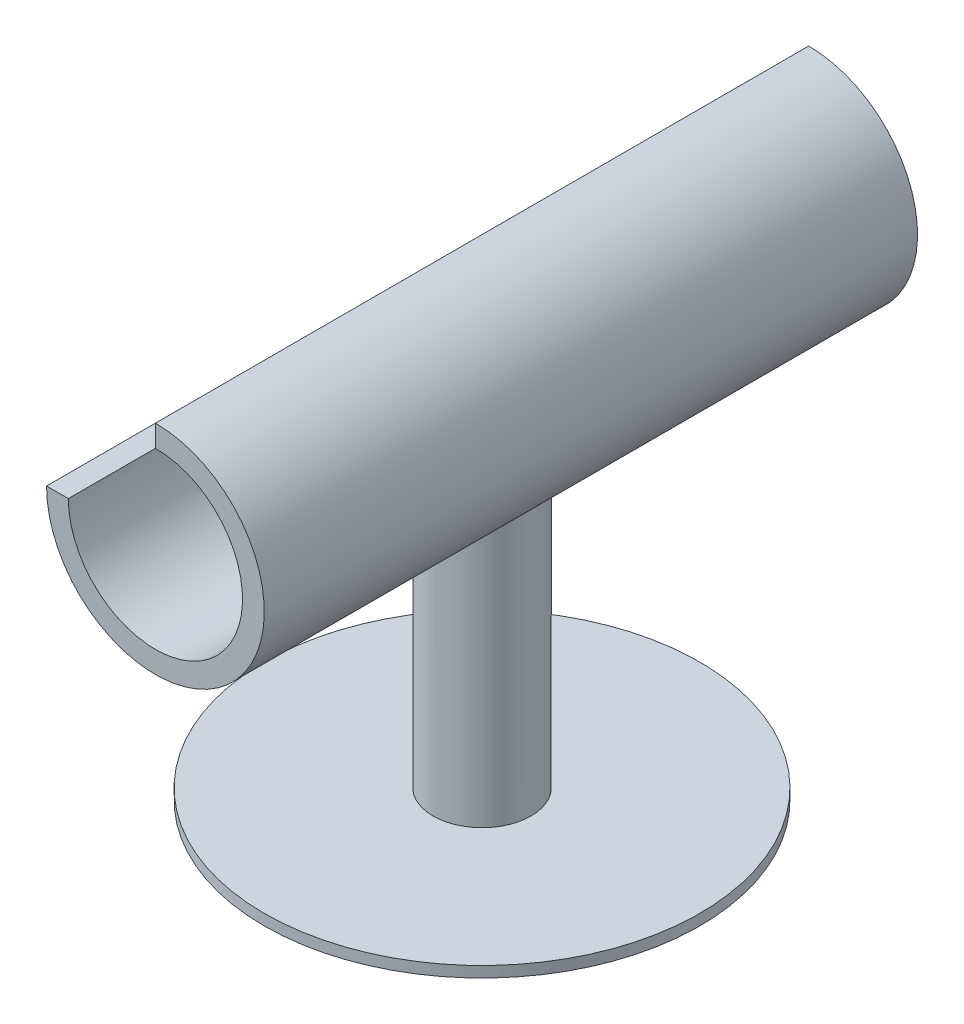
ISO-10303-21;
HEADER;
FILE_DESCRIPTION(('STEP AP214'),'2;1');
FILE_NAME('part.step','',(''),(''),'','','');
FILE_SCHEMA(('AUTOMOTIVE_DESIGN { 1 0 10303 214 1 1 1 1 }'));
ENDSEC;
DATA;
#1=APPLICATION_CONTEXT('core data for automotive mechanical design processes');
#2=APPLICATION_PROTOCOL_DEFINITION('international standard','automotive_design',2000,#1);
#3=PRODUCT_CONTEXT('',#1,'mechanical');
#4=PRODUCT('Part','Part','',(#3));
#5=PRODUCT_RELATED_PRODUCT_CATEGORY('part','',(#4));
#6=PRODUCT_DEFINITION_FORMATION('','',#4);
#7=PRODUCT_DEFINITION_CONTEXT('part definition',#1,'design');
#8=PRODUCT_DEFINITION('design','',#6,#7);
#9=PRODUCT_DEFINITION_SHAPE('','',#8);
#10=(LENGTH_UNIT() NAMED_UNIT(*) SI_UNIT(.MILLI.,.METRE.));
#11=(NAMED_UNIT(*) PLANE_ANGLE_UNIT() SI_UNIT($,.RADIAN.));
#12=(NAMED_UNIT(*) SI_UNIT($,.STERADIAN.) SOLID_ANGLE_UNIT());
#13=UNCERTAINTY_MEASURE_WITH_UNIT(LENGTH_MEASURE(1.E-05),#10,'distance_accuracy_value','');
#14=(GEOMETRIC_REPRESENTATION_CONTEXT(3) GLOBAL_UNCERTAINTY_ASSIGNED_CONTEXT((#13)) GLOBAL_UNIT_ASSIGNED_CONTEXT((#10,
#11,#12)) REPRESENTATION_CONTEXT('',''));
#15=CARTESIAN_POINT('',(0.,0.,0.));
#16=DIRECTION('',(0.,0.,1.));
#17=DIRECTION('',(1.,0.,0.));
#18=AXIS2_PLACEMENT_3D('',#15,#16,#17);
#19=CARTESIAN_POINT('',(0.,0.,120.));
#20=DIRECTION('',(0.,0.,-1.));
#21=DIRECTION('',(-1.,0.,0.));
#22=AXIS2_PLACEMENT_3D('',#19,#20,#21);
#23=CYLINDRICAL_SURFACE('',#22,20.);
#24=CARTESIAN_POINT('',(0.,0.,0.));
#25=DIRECTION('',(0.,0.,1.));
#26=DIRECTION('',(1.,0.,0.));
#27=AXIS2_PLACEMENT_3D('',#24,#25,#26);
#28=CIRCLE('',#27,20.);
#29=CARTESIAN_POINT('',(-20.,0.,0.));
#30=VERTEX_POINT('',#29);
#31=CARTESIAN_POINT('',(0.,20.,0.));
#32=VERTEX_POINT('',#31);
#33=EDGE_CURVE('E87',#30,#32,#28,.T.);
#34=ORIENTED_EDGE('',*,*,#33,.T.);
#35=DIRECTION('',(0.,0.,-1.));
#36=VECTOR('',#35,1.);
#37=CARTESIAN_POINT('',(0.,20.,120.));
#38=LINE('',#37,#36);
#39=CARTESIAN_POINT('',(0.,20.,120.));
#40=VERTEX_POINT('',#39);
#41=EDGE_CURVE('E129',#32,#40,#38,.F.);
#42=ORIENTED_EDGE('',*,*,#41,.T.);
#43=CARTESIAN_POINT('',(0.,0.,120.));
#44=DIRECTION('',(0.,0.,1.));
#45=DIRECTION('',(1.,0.,0.));
#46=AXIS2_PLACEMENT_3D('',#43,#44,#45);
#47=CIRCLE('',#46,20.);
#48=CARTESIAN_POINT('',(-20.,0.,120.));
#49=VERTEX_POINT('',#48);
#50=EDGE_CURVE('E84',#49,#40,#47,.T.);
#51=ORIENTED_EDGE('',*,*,#50,.F.);
#52=DIRECTION('',(0.,0.,-1.));
#53=VECTOR('',#52,1.);
#54=CARTESIAN_POINT('',(-20.,0.,120.));
#55=LINE('',#54,#53);
#56=EDGE_CURVE('E130',#49,#30,#55,.T.);
#57=ORIENTED_EDGE('',*,*,#56,.T.);
#58=EDGE_LOOP('',(#34,#42,#51,#57));
#59=FACE_BOUND('',#58,.T.);
#60=CARTESIAN_POINT('',(0.,-20.,51.));
#61=CARTESIAN_POINT('',(0.239429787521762,-19.9999985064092,51.0000017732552));
#62=CARTESIAN_POINT('',(0.478916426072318,-19.9956892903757,51.0095667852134));
#63=CARTESIAN_POINT('',(0.956162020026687,-19.9785592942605,51.0477313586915));
#64=CARTESIAN_POINT('',(1.19391993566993,-19.965733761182,51.0763415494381));
#65=CARTESIAN_POINT('',(1.66631126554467,-19.9318736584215,51.15235918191));
#66=CARTESIAN_POINT('',(1.90093746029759,-19.9108226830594,51.1998041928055));
#67=CARTESIAN_POINT('',(2.36491141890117,-19.8610585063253,51.3129852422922));
#68=CARTESIAN_POINT('',(2.5942588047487,-19.8323447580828,51.37872258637));
#69=CARTESIAN_POINT('',(3.04529734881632,-19.7681022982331,51.5275532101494));
#70=CARTESIAN_POINT('',(3.26701374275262,-19.7325992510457,51.6105812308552));
#71=CARTESIAN_POINT('',(3.70234023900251,-19.6555728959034,51.7933919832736));
#72=CARTESIAN_POINT('',(3.91595009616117,-19.6140494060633,51.8931752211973));
#73=CARTESIAN_POINT('',(4.33377259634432,-19.5259822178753,52.1086350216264));
#74=CARTESIAN_POINT('',(4.53798969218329,-19.4794409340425,52.2243039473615));
#75=CARTESIAN_POINT('',(4.93616834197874,-19.3823697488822,52.4707841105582));
#76=CARTESIAN_POINT('',(5.13012612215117,-19.3318383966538,52.6016008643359));
#77=CARTESIAN_POINT('',(5.51651224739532,-19.2252516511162,52.8846388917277));
#78=CARTESIAN_POINT('',(5.70834540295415,-19.1690457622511,53.0376162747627));
#79=CARTESIAN_POINT('',(6.07860491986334,-19.0548708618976,53.3584209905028));
#80=CARTESIAN_POINT('',(6.25703067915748,-18.9969017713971,53.5262489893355));
#81=CARTESIAN_POINT('',(6.59969716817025,-18.880592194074,53.8759516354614));
#82=CARTESIAN_POINT('',(6.76392725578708,-18.8222514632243,54.0578366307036));
#83=CARTESIAN_POINT('',(7.07712505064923,-18.7067409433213,54.4345454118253));
#84=CARTESIAN_POINT('',(7.2260976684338,-18.6495707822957,54.6293650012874));
#85=CARTESIAN_POINT('',(7.516447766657,-18.5345311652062,55.0431197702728));
#86=CARTESIAN_POINT('',(7.65683040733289,-18.4768262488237,55.2628006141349));
#87=CARTESIAN_POINT('',(7.9184082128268,-18.3662455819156,55.7143427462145));
#88=CARTESIAN_POINT('',(8.03961140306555,-18.3133678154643,55.9461988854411));
#89=CARTESIAN_POINT('',(8.26179801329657,-18.2142115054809,56.4207118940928));
#90=CARTESIAN_POINT('',(8.36278610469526,-18.1679314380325,56.6633662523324));
#91=CARTESIAN_POINT('',(8.54350708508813,-18.0836512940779,57.1578595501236));
#92=CARTESIAN_POINT('',(8.62324185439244,-18.0456504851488,57.4096976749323));
#93=CARTESIAN_POINT('',(8.7568223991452,-17.9811920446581,57.9069738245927));
#94=CARTESIAN_POINT('',(8.81182321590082,-17.9542263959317,58.1520355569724));
#95=CARTESIAN_POINT('',(8.90123170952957,-17.9100690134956,58.6467638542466));
#96=CARTESIAN_POINT('',(8.93564011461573,-17.8928769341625,58.8964302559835));
#97=CARTESIAN_POINT('',(8.983384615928,-17.8689540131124,59.3981217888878));
#98=CARTESIAN_POINT('',(8.99673325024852,-17.862216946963,59.6501454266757));
#99=CARTESIAN_POINT('',(9.00220633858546,-17.8594595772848,60.154473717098));
#100=CARTESIAN_POINT('',(8.99433221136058,-17.8634385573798,60.4067783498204));
#101=CARTESIAN_POINT('',(8.95918756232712,-17.8810873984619,60.8861517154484));
#102=CARTESIAN_POINT('',(8.93378003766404,-17.8938260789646,61.1133944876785));
#103=CARTESIAN_POINT('',(8.86586762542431,-17.927571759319,61.564765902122));
#104=CARTESIAN_POINT('',(8.82335693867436,-17.9485815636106,61.7888934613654));
#105=CARTESIAN_POINT('',(8.72169967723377,-17.9981983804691,62.2324232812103));
#106=CARTESIAN_POINT('',(8.66255655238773,-18.0268038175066,62.4518265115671));
#107=CARTESIAN_POINT('',(8.52817531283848,-18.0907644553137,62.8847208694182));
#108=CARTESIAN_POINT('',(8.45293084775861,-18.1261223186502,63.0982096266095));
#109=CARTESIAN_POINT('',(8.28516411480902,-18.2034273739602,63.5226817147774));
#110=CARTESIAN_POINT('',(8.19229591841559,-18.245503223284,63.7335046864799));
#111=CARTESIAN_POINT('',(7.99111131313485,-18.3345094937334,64.1466812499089));
#112=CARTESIAN_POINT('',(7.88278828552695,-18.3814419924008,64.3490311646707));
#113=CARTESIAN_POINT('',(7.65143878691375,-18.4789403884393,64.7442514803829));
#114=CARTESIAN_POINT('',(7.52841056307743,-18.529506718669,64.9371207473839));
#115=CARTESIAN_POINT('',(7.26837600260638,-18.6330430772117,65.3125186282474));
#116=CARTESIAN_POINT('',(7.13136875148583,-18.6860132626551,65.4950465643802));
#117=CARTESIAN_POINT('',(6.82965137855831,-18.7985189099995,65.8667508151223));
#118=CARTESIAN_POINT('',(6.66354094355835,-18.8581795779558,66.0547547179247));
#119=CARTESIAN_POINT('',(6.31624490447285,-18.9773217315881,66.4162179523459));
#120=CARTESIAN_POINT('',(6.13506386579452,-19.0368032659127,66.5896816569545));
#121=CARTESIAN_POINT('',(5.75840783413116,-19.1541031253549,66.9212520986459));
#122=CARTESIAN_POINT('',(5.56292293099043,-19.2119202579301,67.0793480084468));
#123=CARTESIAN_POINT('',(5.15888778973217,-19.3243324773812,67.3789636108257));
#124=CARTESIAN_POINT('',(4.95034282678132,-19.3789288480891,67.5204899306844));
#125=CARTESIAN_POINT('',(4.51453513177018,-19.4851436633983,67.7901647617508));
#126=CARTESIAN_POINT('',(4.28689080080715,-19.5366153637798,67.9177557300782));
#127=CARTESIAN_POINT('',(3.82027307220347,-19.6331930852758,68.1531463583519));
#128=CARTESIAN_POINT('',(3.58129930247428,-19.6782988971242,68.2609453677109));
#129=CARTESIAN_POINT('',(3.09381683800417,-19.7608038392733,68.4555980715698));
#130=CARTESIAN_POINT('',(2.84531318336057,-19.7982069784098,68.5424626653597));
#131=CARTESIAN_POINT('',(2.34057316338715,-19.8642006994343,68.6943172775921));
#132=CARTESIAN_POINT('',(2.08433750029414,-19.8927920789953,68.7593092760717));
#133=CARTESIAN_POINT('',(1.58475659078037,-19.9385785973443,68.8627820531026));
#134=CARTESIAN_POINT('',(1.34179468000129,-19.9564408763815,68.9028225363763));
#135=CARTESIAN_POINT('',(0.852923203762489,-19.9833039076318,68.9628768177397));
#136=CARTESIAN_POINT('',(0.607013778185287,-19.9923050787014,68.9828915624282));
#137=CARTESIAN_POINT('',(0.114292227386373,-20.0011908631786,69.0026503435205));
#138=CARTESIAN_POINT('',(-0.132519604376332,-20.0010782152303,69.002400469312));
#139=CARTESIAN_POINT('',(-0.625112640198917,-19.9917460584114,68.9816478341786));
#140=CARTESIAN_POINT('',(-0.870893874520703,-19.9825268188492,68.9611456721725));
#141=CARTESIAN_POINT('',(-1.34474026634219,-19.956065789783,68.901977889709));
#142=CARTESIAN_POINT('',(-1.57298140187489,-19.9393402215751,68.8644796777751));
#143=CARTESIAN_POINT('',(-2.02534431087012,-19.8984816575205,68.7721881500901));
#144=CARTESIAN_POINT('',(-2.24946463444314,-19.8743461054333,68.7173888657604));
#145=CARTESIAN_POINT('',(-2.69199160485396,-19.8192555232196,68.5910486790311));
#146=CARTESIAN_POINT('',(-2.910399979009,-19.7883025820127,68.5195129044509));
#147=CARTESIAN_POINT('',(-3.34035601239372,-19.7202793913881,68.3602989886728));
#148=CARTESIAN_POINT('',(-3.55190097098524,-19.683206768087,68.272614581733));
#149=CARTESIAN_POINT('',(-3.97325271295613,-19.6025680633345,68.0789025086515));
#150=CARTESIAN_POINT('',(-4.18280716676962,-19.5588376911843,67.9723947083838));
#151=CARTESIAN_POINT('',(-4.59227389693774,-19.4667686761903,67.7437737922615));
#152=CARTESIAN_POINT('',(-4.79218192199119,-19.4184280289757,67.6216538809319));
#153=CARTESIAN_POINT('',(-5.18130478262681,-19.3182414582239,67.3626566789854));
#154=CARTESIAN_POINT('',(-5.3705181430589,-19.2663950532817,67.2257773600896));
#155=CARTESIAN_POINT('',(-5.73735089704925,-19.1603566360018,66.9380937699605));
#156=CARTESIAN_POINT('',(-5.91496960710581,-19.1061644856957,66.7872886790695));
#157=CARTESIAN_POINT('',(-6.2719811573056,-18.9921091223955,66.4595449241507));
#158=CARTESIAN_POINT('',(-6.45030692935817,-18.932147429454,66.2814764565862));
#159=CARTESIAN_POINT('',(-6.7913900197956,-18.8124874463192,65.9110401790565));
#160=CARTESIAN_POINT('',(-6.95415222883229,-18.7527890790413,65.7186768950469));
#161=CARTESIAN_POINT('',(-7.26330947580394,-18.6352274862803,65.320516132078));
#162=CARTESIAN_POINT('',(-7.40969604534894,-18.5773652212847,65.1147117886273));
#163=CARTESIAN_POINT('',(-7.68506041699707,-18.4651553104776,64.6908135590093));
#164=CARTESIAN_POINT('',(-7.81403605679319,-18.4108081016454,64.4727181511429));
#165=CARTESIAN_POINT('',(-8.05668444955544,-18.3059488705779,64.0196474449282));
#166=CARTESIAN_POINT('',(-8.16987395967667,-18.2555727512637,63.7843811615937));
#167=CARTESIAN_POINT('',(-8.37575861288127,-18.1620334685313,63.3037809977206));
#168=CARTESIAN_POINT('',(-8.4684634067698,-18.1188669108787,63.0584519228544));
#169=CARTESIAN_POINT('',(-8.63237146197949,-18.0413522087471,62.5595056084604));
#170=CARTESIAN_POINT('',(-8.7035874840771,-18.0069988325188,62.3058933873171));
#171=CARTESIAN_POINT('',(-8.82367465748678,-17.9484608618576,61.7922869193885));
#172=CARTESIAN_POINT('',(-8.87254842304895,-17.9242750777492,61.5322934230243));
#173=CARTESIAN_POINT('',(-8.94404152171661,-17.8886993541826,61.0308377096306));
#174=CARTESIAN_POINT('',(-8.96856120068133,-17.8763859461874,60.7897105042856));
#175=CARTESIAN_POINT('',(-8.9980603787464,-17.8615562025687,60.3059669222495));
#176=CARTESIAN_POINT('',(-9.00304105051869,-17.85903927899,60.0633506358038));
#177=CARTESIAN_POINT('',(-8.99339869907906,-17.8638967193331,59.5786600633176));
#178=CARTESIAN_POINT('',(-8.97877958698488,-17.871269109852,59.3365856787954));
#179=CARTESIAN_POINT('',(-8.93013553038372,-17.8956256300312,58.8548902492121));
#180=CARTESIAN_POINT('',(-8.89611092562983,-17.9126095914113,58.6152691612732));
#181=CARTESIAN_POINT('',(-8.81184885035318,-17.9542019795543,58.1554284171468));
#182=CARTESIAN_POINT('',(-8.76277836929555,-17.9782576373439,57.9349431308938));
#183=CARTESIAN_POINT('',(-8.6484703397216,-18.0335240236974,57.4990500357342));
#184=CARTESIAN_POINT('',(-8.58322729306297,-18.0647371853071,57.2836439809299));
#185=CARTESIAN_POINT('',(-8.43717617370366,-18.1334100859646,56.8592350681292));
#186=CARTESIAN_POINT('',(-8.35637030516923,-18.1708689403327,56.6502313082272));
#187=CARTESIAN_POINT('',(-8.17983194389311,-18.2510202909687,56.2396340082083));
#188=CARTESIAN_POINT('',(-8.08409398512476,-18.2937147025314,56.0380432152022));
#189=CARTESIAN_POINT('',(-7.76222657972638,-18.4337980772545,55.4204728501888));
#190=CARTESIAN_POINT('',(-7.51078499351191,-18.5385811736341,55.0190344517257));
#191=CARTESIAN_POINT('',(-6.94944527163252,-18.7562139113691,54.2617425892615));
#192=CARTESIAN_POINT('',(-6.63952195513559,-18.8690670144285,53.9059088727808));
#193=CARTESIAN_POINT('',(-6.12049570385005,-19.0414534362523,53.3965519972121));
#194=CARTESIAN_POINT('',(-5.92952447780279,-19.1019265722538,53.2245389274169));
#195=CARTESIAN_POINT('',(-5.53314695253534,-19.2204841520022,52.8971627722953));
#196=CARTESIAN_POINT('',(-5.32774520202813,-19.2785693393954,52.7417944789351));
#197=CARTESIAN_POINT('',(-4.903490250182,-19.3908219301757,52.448687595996));
#198=CARTESIAN_POINT('',(-4.68462744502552,-19.4449864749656,52.3109618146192));
#199=CARTESIAN_POINT('',(-4.23488494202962,-19.5478628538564,52.0543876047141));
#200=CARTESIAN_POINT('',(-4.00400615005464,-19.5965750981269,51.935537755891));
#201=CARTESIAN_POINT('',(-3.53403247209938,-19.6867289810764,51.7188824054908));
#202=CARTESIAN_POINT('',(-3.2950403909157,-19.728237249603,51.6208819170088));
#203=CARTESIAN_POINT('',(-2.80841945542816,-19.8033675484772,51.4454894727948));
#204=CARTESIAN_POINT('',(-2.56079156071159,-19.8369904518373,51.3680952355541));
#205=CARTESIAN_POINT('',(-2.0594421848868,-19.895281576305,51.234967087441));
#206=CARTESIAN_POINT('',(-1.80573806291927,-19.9199726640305,51.1791778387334));
#207=CARTESIAN_POINT('',(-1.29384700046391,-19.9597536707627,51.0897034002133));
#208=CARTESIAN_POINT('',(-1.03566326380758,-19.9748501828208,51.0560030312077));
#209=CARTESIAN_POINT('',(-0.647365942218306,-19.9899382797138,51.0223771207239));
#210=CARTESIAN_POINT('',(-0.518072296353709,-19.9937081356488,51.0139892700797));
#211=CARTESIAN_POINT('',(-0.259191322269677,-19.9987394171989,51.0028001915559));
#212=CARTESIAN_POINT('',(-0.129603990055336,-20.0000008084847,50.9999990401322));
#213=CARTESIAN_POINT('',(0.,-20.,51.));
#214=B_SPLINE_CURVE_WITH_KNOTS('',3,(#60,#61,#62,#63,#64,#65,#66,#67,#68,#69,#70,#71,#72,#73,
#74,#75,#76,#77,#78,#79,#80,#81,#82,#83,#84,#85,#86,#87,#88,#89,#90,#91,#92,#93,#94,#95,#96,#97,
#98,#99,#100,#101,#102,#103,#104,#105,#106,#107,#108,#109,#110,#111,#112,#113,#114,#115,#116,
#117,#118,#119,#120,#121,#122,#123,#124,#125,#126,#127,#128,#129,#130,#131,#132,#133,#134,#135,
#136,#137,#138,#139,#140,#141,#142,#143,#144,#145,#146,#147,#148,#149,#150,#151,#152,#153,#154,
#155,#156,#157,#158,#159,#160,#161,#162,#163,#164,#165,#166,#167,#168,#169,#170,#171,#172,#173,
#174,#175,#176,#177,#178,#179,#180,#181,#182,#183,#184,#185,#186,#187,#188,#189,#190,#191,#192,
#193,#194,#195,#196,#197,#198,#199,#200,#201,#202,#203,#204,#205,#206,#207,#208,#209,#210,#211,
#212,#213),.UNSPECIFIED.,.T.,.F.,(4,2,2,2,2,2,2,2,2,2,2,2,2,2,2,2,2,2,2,2,2,2,2,2,2,2,2,2,2,2,2,
2,2,2,2,2,2,2,2,2,2,2,2,2,2,2,2,2,2,2,2,2,2,2,2,2,2,2,2,2,2,2,2,2,2,2,2,2,2,2,2,2,2,2,2,2,4),
(0.,0.718159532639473,1.43672021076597,2.15672143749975,2.87677406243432,3.59415675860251,
4.31156113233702,5.02862182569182,5.74594447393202,6.50027585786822,7.25464109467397,
8.0095670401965,8.76424924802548,9.564296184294,10.364007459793,11.1635337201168,
11.9629892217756,12.7197566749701,13.4764973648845,14.2327873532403,14.9890267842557,
15.6752612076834,16.3617285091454,17.0480535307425,17.7346497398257,18.4364610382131,
19.1385738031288,19.8407703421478,20.5430128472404,21.3157604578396,22.0882748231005,
22.861329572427,23.634074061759,24.4310112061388,25.2279745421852,26.0245220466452,
26.820997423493,27.5606908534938,28.3003493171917,29.0397855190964,29.7791998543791,
30.4741133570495,31.1692668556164,31.8642076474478,32.5594186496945,33.2759532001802,
33.9928007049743,34.7097468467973,35.426735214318,36.2029926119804,36.9790052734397,
37.7554173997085,38.53192586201,39.3285593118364,40.1248166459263,40.9206002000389,
41.716290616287,42.4433761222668,43.1704179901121,43.8973147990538,44.6241988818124,
45.3049160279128,45.9858649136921,46.6667174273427,47.347819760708,48.7968393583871,
50.2464842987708,51.0377977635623,51.8288629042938,52.6204991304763,53.4120757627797,
54.1958878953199,54.9796132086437,55.7613176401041,56.5424843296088,56.931220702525,
57.3199623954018),.UNSPECIFIED.);
#215=CARTESIAN_POINT('',(0.,-20.,51.));
#216=VERTEX_POINT('',#215);
#217=EDGE_CURVE('E97',#216,#216,#214,.T.);
#218=ORIENTED_EDGE('',*,*,#217,.F.);
#219=EDGE_LOOP('',(#218));
#220=FACE_BOUND('',#219,.T.);
#221=ADVANCED_FACE('F33',(#59,#220),#23,.T.);
#222=CARTESIAN_POINT('',(0.,0.,120.));
#223=DIRECTION('',(0.,0.,1.));
#224=DIRECTION('',(1.,0.,0.));
#225=AXIS2_PLACEMENT_3D('',#222,#223,#224);
#226=PLANE('',#225);
#227=DIRECTION('',(0.,1.,0.));
#228=VECTOR('',#227,1.);
#229=CARTESIAN_POINT('',(0.,0.,120.));
#230=LINE('',#229,#228);
#231=CARTESIAN_POINT('',(0.,16.,120.));
#232=VERTEX_POINT('',#231);
#233=EDGE_CURVE('E72',#232,#40,#230,.T.);
#234=ORIENTED_EDGE('',*,*,#233,.F.);
#235=CARTESIAN_POINT('',(0.,0.,120.));
#236=DIRECTION('',(0.,0.,1.));
#237=DIRECTION('',(1.,0.,0.));
#238=AXIS2_PLACEMENT_3D('',#235,#236,#237);
#239=CIRCLE('',#238,16.);
#240=CARTESIAN_POINT('',(-16.,0.,120.));
#241=VERTEX_POINT('',#240);
#242=EDGE_CURVE('E82',#241,#232,#239,.T.);
#243=ORIENTED_EDGE('',*,*,#242,.F.);
#244=DIRECTION('',(1.,0.,0.));
#245=VECTOR('',#244,1.);
#246=CARTESIAN_POINT('',(0.,0.,120.));
#247=LINE('',#246,#245);
#248=EDGE_CURVE('E55',#49,#241,#247,.T.);
#249=ORIENTED_EDGE('',*,*,#248,.F.);
#250=ORIENTED_EDGE('',*,*,#50,.T.);
#251=EDGE_LOOP('',(#234,#243,#249,#250));
#252=FACE_BOUND('',#251,.T.);
#253=ADVANCED_FACE('F81',(#252),#226,.T.);
#254=CARTESIAN_POINT('',(0.,0.,0.));
#255=DIRECTION('',(0.,0.,1.));
#256=DIRECTION('',(1.,0.,0.));
#257=AXIS2_PLACEMENT_3D('',#254,#255,#256);
#258=PLANE('',#257);
#259=CARTESIAN_POINT('',(0.,0.,0.));
#260=DIRECTION('',(0.,0.,1.));
#261=DIRECTION('',(1.,0.,0.));
#262=AXIS2_PLACEMENT_3D('',#259,#260,#261);
#263=CIRCLE('',#262,16.);
#264=CARTESIAN_POINT('',(-16.,0.,0.));
#265=VERTEX_POINT('',#264);
#266=CARTESIAN_POINT('',(0.,16.,0.));
#267=VERTEX_POINT('',#266);
#268=EDGE_CURVE('E88',#265,#267,#263,.T.);
#269=ORIENTED_EDGE('',*,*,#268,.T.);
#270=DIRECTION('',(0.,1.,0.));
#271=VECTOR('',#270,1.);
#272=CARTESIAN_POINT('',(0.,0.,0.));
#273=LINE('',#272,#271);
#274=EDGE_CURVE('E47',#267,#32,#273,.T.);
#275=ORIENTED_EDGE('',*,*,#274,.T.);
#276=ORIENTED_EDGE('',*,*,#33,.F.);
#277=DIRECTION('',(1.,0.,0.));
#278=VECTOR('',#277,1.);
#279=CARTESIAN_POINT('',(0.,0.,0.));
#280=LINE('',#279,#278);
#281=EDGE_CURVE('E132',#30,#265,#280,.T.);
#282=ORIENTED_EDGE('',*,*,#281,.T.);
#283=EDGE_LOOP('',(#269,#275,#276,#282));
#284=FACE_BOUND('',#283,.T.);
#285=ADVANCED_FACE('F114',(#284),#258,.F.);
#286=CARTESIAN_POINT('',(0.,0.,120.));
#287=DIRECTION('',(0.,0.,-1.));
#288=DIRECTION('',(-1.,0.,0.));
#289=AXIS2_PLACEMENT_3D('',#286,#287,#288);
#290=CYLINDRICAL_SURFACE('',#289,16.);
#291=DIRECTION('',(0.,0.,-1.));
#292=VECTOR('',#291,1.);
#293=CARTESIAN_POINT('',(0.,16.,120.));
#294=LINE('',#293,#292);
#295=EDGE_CURVE('E11',#267,#232,#294,.F.);
#296=ORIENTED_EDGE('',*,*,#295,.F.);
#297=ORIENTED_EDGE('',*,*,#268,.F.);
#298=DIRECTION('',(0.,0.,-1.));
#299=VECTOR('',#298,1.);
#300=CARTESIAN_POINT('',(-16.,0.,120.));
#301=LINE('',#300,#299);
#302=EDGE_CURVE('E41',#241,#265,#301,.T.);
#303=ORIENTED_EDGE('',*,*,#302,.F.);
#304=ORIENTED_EDGE('',*,*,#242,.T.);
#305=EDGE_LOOP('',(#296,#297,#303,#304));
#306=FACE_BOUND('',#305,.T.);
#307=ADVANCED_FACE('F86',(#306),#290,.F.);
#308=CARTESIAN_POINT('',(0.,20.001,60.));
#309=DIRECTION('',(0.,-1.,0.));
#310=DIRECTION('',(0.,0.,-1.));
#311=AXIS2_PLACEMENT_3D('',#308,#309,#310);
#312=CYLINDRICAL_SURFACE('',#311,9.);
#313=CARTESIAN_POINT('',(0.,-68.,60.));
#314=DIRECTION('',(0.,1.,0.));
#315=DIRECTION('',(0.,0.,1.));
#316=AXIS2_PLACEMENT_3D('',#313,#314,#315);
#317=CIRCLE('',#316,9.);
#318=CARTESIAN_POINT('',(0.,-68.,69.));
#319=VERTEX_POINT('',#318);
#320=EDGE_CURVE('E92',#319,#319,#317,.T.);
#321=ORIENTED_EDGE('',*,*,#320,.T.);
#322=EDGE_LOOP('',(#321));
#323=FACE_BOUND('',#322,.T.);
#324=ORIENTED_EDGE('',*,*,#217,.T.);
#325=EDGE_LOOP('',(#324));
#326=FACE_BOUND('',#325,.T.);
#327=ADVANCED_FACE('F103',(#323,#326),#312,.T.);
#328=CARTESIAN_POINT('',(0.,-68.,60.));
#329=DIRECTION('',(0.,1.,0.));
#330=DIRECTION('',(0.,0.,1.));
#331=AXIS2_PLACEMENT_3D('',#328,#329,#330);
#332=PLANE('',#331);
#333=CARTESIAN_POINT('',(0.,-68.,60.));
#334=DIRECTION('',(0.,1.,0.));
#335=DIRECTION('',(0.,0.,1.));
#336=AXIS2_PLACEMENT_3D('',#333,#334,#335);
#337=CIRCLE('',#336,40.);
#338=CARTESIAN_POINT('',(0.,-68.,100.));
#339=VERTEX_POINT('',#338);
#340=EDGE_CURVE('E140',#339,#339,#337,.T.);
#341=ORIENTED_EDGE('',*,*,#340,.T.);
#342=EDGE_LOOP('',(#341));
#343=FACE_BOUND('',#342,.T.);
#344=ORIENTED_EDGE('',*,*,#320,.F.);
#345=EDGE_LOOP('',(#344));
#346=FACE_BOUND('',#345,.T.);
#347=ADVANCED_FACE('F108',(#343,#346),#332,.T.);
#348=CARTESIAN_POINT('',(0.,-68.,60.));
#349=DIRECTION('',(0.,-1.,0.));
#350=DIRECTION('',(0.,0.,-1.));
#351=AXIS2_PLACEMENT_3D('',#348,#349,#350);
#352=CYLINDRICAL_SURFACE('',#351,40.);
#353=ORIENTED_EDGE('',*,*,#340,.F.);
#354=EDGE_LOOP('',(#353));
#355=FACE_BOUND('',#354,.T.);
#356=CARTESIAN_POINT('',(0.,-70.,60.));
#357=DIRECTION('',(0.,1.,0.));
#358=DIRECTION('',(0.,0.,1.));
#359=AXIS2_PLACEMENT_3D('',#356,#357,#358);
#360=CIRCLE('',#359,40.);
#361=CARTESIAN_POINT('',(0.,-70.,100.));
#362=VERTEX_POINT('',#361);
#363=EDGE_CURVE('E139',#362,#362,#360,.T.);
#364=ORIENTED_EDGE('',*,*,#363,.T.);
#365=EDGE_LOOP('',(#364));
#366=FACE_BOUND('',#365,.T.);
#367=ADVANCED_FACE('F110',(#355,#366),#352,.T.);
#368=CARTESIAN_POINT('',(0.,-70.,60.));
#369=DIRECTION('',(0.,1.,0.));
#370=DIRECTION('',(0.,0.,1.));
#371=AXIS2_PLACEMENT_3D('',#368,#369,#370);
#372=PLANE('',#371);
#373=ORIENTED_EDGE('',*,*,#363,.F.);
#374=EDGE_LOOP('',(#373));
#375=FACE_BOUND('',#374,.T.);
#376=ADVANCED_FACE('F146',(#375),#372,.F.);
#377=CARTESIAN_POINT('',(0.,0.,0.));
#378=DIRECTION('',(0.,-1.,0.));
#379=DIRECTION('',(0.,0.,-1.));
#380=AXIS2_PLACEMENT_3D('',#377,#378,#379);
#381=PLANE('',#380);
#382=ORIENTED_EDGE('',*,*,#248,.T.);
#383=ORIENTED_EDGE('',*,*,#302,.T.);
#384=ORIENTED_EDGE('',*,*,#281,.F.);
#385=ORIENTED_EDGE('',*,*,#56,.F.);
#386=EDGE_LOOP('',(#382,#383,#384,#385));
#387=FACE_BOUND('',#386,.T.);
#388=ADVANCED_FACE('F148',(#387),#381,.F.);
#389=CARTESIAN_POINT('',(0.,0.,0.));
#390=DIRECTION('',(1.,0.,0.));
#391=DIRECTION('',(0.,0.,-1.));
#392=AXIS2_PLACEMENT_3D('',#389,#390,#391);
#393=PLANE('',#392);
#394=ORIENTED_EDGE('',*,*,#274,.F.);
#395=ORIENTED_EDGE('',*,*,#295,.T.);
#396=ORIENTED_EDGE('',*,*,#233,.T.);
#397=ORIENTED_EDGE('',*,*,#41,.F.);
#398=EDGE_LOOP('',(#394,#395,#396,#397));
#399=FACE_BOUND('',#398,.T.);
#400=ADVANCED_FACE('F71',(#399),#393,.F.);
#401=CLOSED_SHELL('',(#221,#253,#285,#307,#327,#347,#367,#376,#388,#400));
#402=MANIFOLD_SOLID_BREP('B2',#401);
#403=ADVANCED_BREP_SHAPE_REPRESENTATION('',(#18,#402),#14);
#404=SHAPE_DEFINITION_REPRESENTATION(#9,#403);
ENDSEC;
END-ISO-10303-21;
